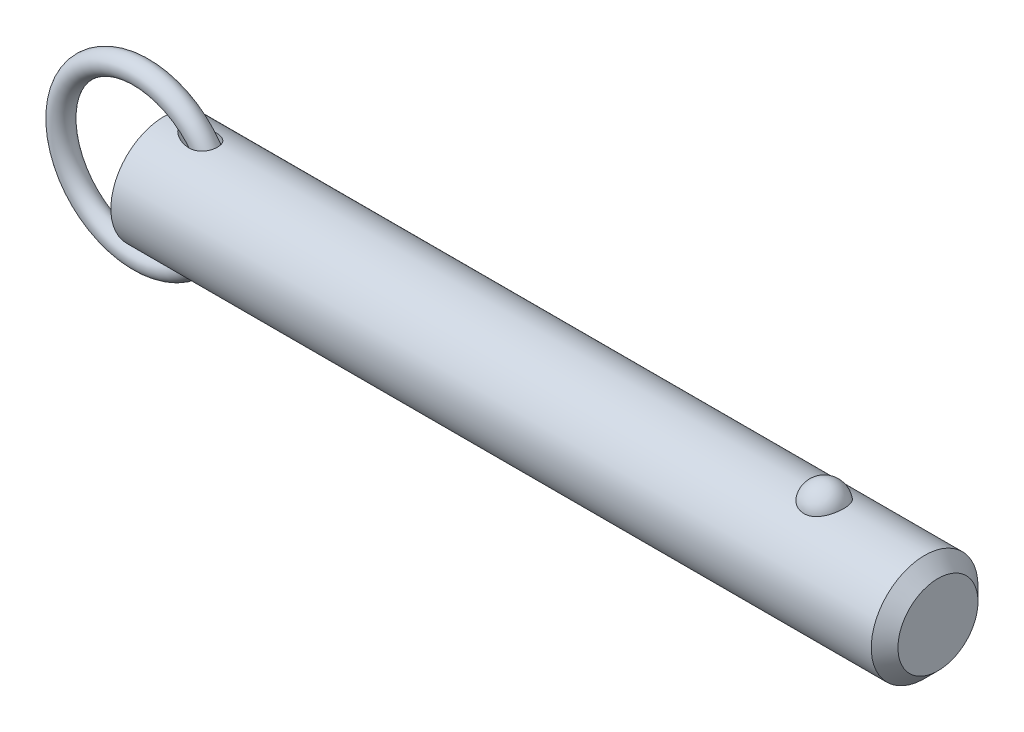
ISO-10303-21;
HEADER;
FILE_DESCRIPTION(('STEP AP214'),'2;1');
FILE_NAME('part.step','',(''),(''),'','','');
FILE_SCHEMA(('AUTOMOTIVE_DESIGN { 1 0 10303 214 1 1 1 1 }'));
ENDSEC;
DATA;
#1=APPLICATION_CONTEXT('core data for automotive mechanical design processes');
#2=APPLICATION_PROTOCOL_DEFINITION('international standard','automotive_design',2000,#1);
#3=PRODUCT_CONTEXT('',#1,'mechanical');
#4=PRODUCT('Part','Part','',(#3));
#5=PRODUCT_RELATED_PRODUCT_CATEGORY('part','',(#4));
#6=PRODUCT_DEFINITION_FORMATION('','',#4);
#7=PRODUCT_DEFINITION_CONTEXT('part definition',#1,'design');
#8=PRODUCT_DEFINITION('design','',#6,#7);
#9=PRODUCT_DEFINITION_SHAPE('','',#8);
#10=(LENGTH_UNIT() NAMED_UNIT(*) SI_UNIT(.MILLI.,.METRE.));
#11=(NAMED_UNIT(*) PLANE_ANGLE_UNIT() SI_UNIT($,.RADIAN.));
#12=(NAMED_UNIT(*) SI_UNIT($,.STERADIAN.) SOLID_ANGLE_UNIT());
#13=UNCERTAINTY_MEASURE_WITH_UNIT(LENGTH_MEASURE(1.E-05),#10,'distance_accuracy_value','');
#14=(GEOMETRIC_REPRESENTATION_CONTEXT(3) GLOBAL_UNCERTAINTY_ASSIGNED_CONTEXT((#13)) GLOBAL_UNIT_ASSIGNED_CONTEXT((#10,
#11,#12)) REPRESENTATION_CONTEXT('',''));
#15=CARTESIAN_POINT('',(0.,0.,0.));
#16=DIRECTION('',(0.,0.,1.));
#17=DIRECTION('',(1.,0.,0.));
#18=AXIS2_PLACEMENT_3D('',#15,#16,#17);
#19=CARTESIAN_POINT('',(-5.53898640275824,0.,0.));
#20=DIRECTION('',(0.,0.,1.));
#21=DIRECTION('',(1.,0.,0.));
#22=AXIS2_PLACEMENT_3D('',#19,#20,#21);
#23=TOROIDAL_SURFACE('',#22,19.05,2.54);
#24=CARTESIAN_POINT('',(16.0510135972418,0.,0.));
#25=VERTEX_POINT('',#24);
#26=VERTEX_LOOP('',#25);
#27=FACE_BOUND('',#26,.T.);
#28=ADVANCED_FACE('P0_F12',(#27),#23,.T.);
#29=CLOSED_SHELL('',(#28));
#30=MANIFOLD_SOLID_BREP('P0_B1',#29);
#31=CARTESIAN_POINT('',(0.,0.,0.));
#32=DIRECTION('',(1.,0.,0.));
#33=DIRECTION('',(0.,0.,-1.));
#34=AXIS2_PLACEMENT_3D('',#31,#32,#33);
#35=CYLINDRICAL_SURFACE('',#34,12.7);
#36=CARTESIAN_POINT('',(180.975,0.,0.));
#37=DIRECTION('',(1.,0.,0.));
#38=DIRECTION('',(0.,0.,-1.));
#39=AXIS2_PLACEMENT_3D('',#36,#37,#38);
#40=CIRCLE('',#39,12.7);
#41=CARTESIAN_POINT('',(180.975,0.,-12.7));
#42=VERTEX_POINT('',#41);
#43=EDGE_CURVE('P1_E89',#42,#42,#40,.T.);
#44=ORIENTED_EDGE('',*,*,#43,.F.);
#45=EDGE_LOOP('',(#44));
#46=FACE_BOUND('',#45,.T.);
#47=CARTESIAN_POINT('',(0.,0.,0.));
#48=DIRECTION('',(1.,0.,0.));
#49=DIRECTION('',(0.,0.,-1.));
#50=AXIS2_PLACEMENT_3D('',#47,#48,#49);
#51=CIRCLE('',#50,12.7);
#52=CARTESIAN_POINT('',(0.,0.,-12.7));
#53=VERTEX_POINT('',#52);
#54=EDGE_CURVE('P1_E52',#53,#53,#51,.T.);
#55=ORIENTED_EDGE('',*,*,#54,.T.);
#56=EDGE_LOOP('',(#55));
#57=FACE_BOUND('',#56,.T.);
#58=CARTESIAN_POINT('',(157.060042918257,11.7500437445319,4.81938502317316));
#59=CARTESIAN_POINT('',(156.935088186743,11.7500430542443,4.81938571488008));
#60=CARTESIAN_POINT('',(156.810144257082,11.7520975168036,4.81438658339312));
#61=CARTESIAN_POINT('',(156.561142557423,11.760253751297,4.79442904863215));
#62=CARTESIAN_POINT('',(156.437085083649,11.7663568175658,4.77946746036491));
#63=CARTESIAN_POINT('',(156.190901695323,11.7824262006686,4.73971414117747));
#64=CARTESIAN_POINT('',(156.068774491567,11.7923898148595,4.71492928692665));
#65=CARTESIAN_POINT('',(155.827187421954,11.8158938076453,4.65571340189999));
#66=CARTESIAN_POINT('',(155.70772859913,11.8294355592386,4.62127866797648));
#67=CARTESIAN_POINT('',(155.472557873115,11.8596812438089,4.54309502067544));
#68=CARTESIAN_POINT('',(155.356839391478,11.8763792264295,4.49936361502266));
#69=CARTESIAN_POINT('',(155.129653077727,11.9124878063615,4.40287235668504));
#70=CARTESIAN_POINT('',(155.018186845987,11.9318994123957,4.35010914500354));
#71=CARTESIAN_POINT('',(154.691278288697,11.9934256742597,4.17881316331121));
#72=CARTESIAN_POINT('',(154.483127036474,12.038858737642,4.04720756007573));
#73=CARTESIAN_POINT('',(154.085850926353,12.1352173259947,3.74856446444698));
#74=CARTESIAN_POINT('',(153.897443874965,12.1862630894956,3.58061821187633));
#75=CARTESIAN_POINT('',(153.550521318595,12.2875163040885,3.21600758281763));
#76=CARTESIAN_POINT('',(153.392011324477,12.3377235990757,3.01933792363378));
#77=CARTESIAN_POINT('',(153.10168878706,12.4344923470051,2.59291655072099));
#78=CARTESIAN_POINT('',(152.971376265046,12.4807925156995,2.36208286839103));
#79=CARTESIAN_POINT('',(152.749407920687,12.5623454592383,1.88070399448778));
#80=CARTESIAN_POINT('',(152.657755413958,12.5975972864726,1.63015711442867));
#81=CARTESIAN_POINT('',(152.514046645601,12.6538414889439,1.1129886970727));
#82=CARTESIAN_POINT('',(152.462499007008,12.6746503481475,0.846205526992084));
#83=CARTESIAN_POINT('',(152.401977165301,12.699153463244,0.307085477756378));
#84=CARTESIAN_POINT('',(152.393001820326,12.7028481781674,0.0347487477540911));
#85=CARTESIAN_POINT('',(152.417731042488,12.6927785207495,-0.506073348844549));
#86=CARTESIAN_POINT('',(152.451189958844,12.6791146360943,-0.774571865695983));
#87=CARTESIAN_POINT('',(152.559687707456,12.635882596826,-1.3017024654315));
#88=CARTESIAN_POINT('',(152.63472729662,12.6063141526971,-1.56033436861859));
#89=CARTESIAN_POINT('',(152.825000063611,12.5342328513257,-2.06083899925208));
#90=CARTESIAN_POINT('',(152.940287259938,12.4917026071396,-2.30268867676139));
#91=CARTESIAN_POINT('',(153.208704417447,12.3981123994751,-2.76259600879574));
#92=CARTESIAN_POINT('',(153.361837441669,12.3470517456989,-2.98065173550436));
#93=CARTESIAN_POINT('',(153.703507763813,12.2416045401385,-3.387863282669));
#94=CARTESIAN_POINT('',(153.892201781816,12.1872040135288,-3.57688418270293));
#95=CARTESIAN_POINT('',(154.300239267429,12.0814086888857,-3.91941073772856));
#96=CARTESIAN_POINT('',(154.519580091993,12.0300136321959,-4.07291945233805));
#97=CARTESIAN_POINT('',(154.978375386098,11.9373542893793,-4.33691289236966));
#98=CARTESIAN_POINT('',(155.217304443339,11.8958982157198,-4.44824125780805));
#99=CARTESIAN_POINT('',(155.71243761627,11.8268116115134,-4.62881985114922));
#100=CARTESIAN_POINT('',(155.968635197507,11.7991758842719,-4.69808589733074));
#101=CARTESIAN_POINT('',(156.477164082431,11.7622209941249,-4.78983181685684));
#102=CARTESIAN_POINT('',(156.729041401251,11.7520502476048,-4.8144902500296));
#103=CARTESIAN_POINT('',(157.233573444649,11.7485796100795,-4.82295735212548));
#104=CARTESIAN_POINT('',(157.486228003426,11.7552763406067,-4.80677420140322));
#105=CARTESIAN_POINT('',(157.976834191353,11.7842584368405,-4.73525430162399));
#106=CARTESIAN_POINT('',(158.214998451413,11.8060486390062,-4.68116061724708));
#107=CARTESIAN_POINT('',(158.678489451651,11.8622750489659,-4.53678133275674));
#108=CARTESIAN_POINT('',(158.903815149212,11.8967122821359,-4.44649279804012));
#109=CARTESIAN_POINT('',(159.340801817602,11.9754603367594,-4.22987613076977));
#110=CARTESIAN_POINT('',(159.552057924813,12.0199699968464,-4.10280539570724));
#111=CARTESIAN_POINT('',(159.950601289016,12.1138028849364,-3.81685409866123));
#112=CARTESIAN_POINT('',(160.137883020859,12.163127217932,-3.65796622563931));
#113=CARTESIAN_POINT('',(160.493350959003,12.2642343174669,-3.30364864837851));
#114=CARTESIAN_POINT('',(160.660111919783,12.3160165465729,-3.10678783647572));
#115=CARTESIAN_POINT('',(160.959579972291,12.4142566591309,-2.68748409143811));
#116=CARTESIAN_POINT('',(161.092280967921,12.4607135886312,-2.46503658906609));
#117=CARTESIAN_POINT('',(161.324691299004,12.5450236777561,-1.99289519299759));
#118=CARTESIAN_POINT('',(161.423215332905,12.5825557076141,-1.74255918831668));
#119=CARTESIAN_POINT('',(161.579227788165,12.6431720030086,-1.2277373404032));
#120=CARTESIAN_POINT('',(161.636715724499,12.6662560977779,-0.963251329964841));
#121=CARTESIAN_POINT('',(161.709544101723,12.6956486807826,-0.427355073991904));
#122=CARTESIAN_POINT('',(161.724837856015,12.7019385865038,-0.155937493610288));
#123=CARTESIAN_POINT('',(161.712779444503,12.6970201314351,0.385928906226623));
#124=CARTESIAN_POINT('',(161.68542805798,12.6858120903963,0.656377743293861));
#125=CARTESIAN_POINT('',(161.613060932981,12.6568455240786,1.05454017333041));
#126=CARTESIAN_POINT('',(161.583796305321,12.6451962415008,1.18577850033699));
#127=CARTESIAN_POINT('',(161.515022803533,12.6181819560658,1.44513808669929));
#128=CARTESIAN_POINT('',(161.475517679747,12.6028183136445,1.57326046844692));
#129=CARTESIAN_POINT('',(161.386439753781,12.5687547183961,1.82554978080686));
#130=CARTESIAN_POINT('',(161.336862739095,12.5500533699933,1.94971503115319));
#131=CARTESIAN_POINT('',(161.22792115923,12.5098093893,2.1931437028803));
#132=CARTESIAN_POINT('',(161.168560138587,12.4882677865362,2.31240887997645));
#133=CARTESIAN_POINT('',(161.03997128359,12.4427679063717,2.54593031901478));
#134=CARTESIAN_POINT('',(160.970688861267,12.4187964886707,2.6601539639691));
#135=CARTESIAN_POINT('',(160.822903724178,12.3691892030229,2.88202659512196));
#136=CARTESIAN_POINT('',(160.744404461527,12.3435539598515,2.98967802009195));
#137=CARTESIAN_POINT('',(160.578550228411,12.2912955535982,3.19774385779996));
#138=CARTESIAN_POINT('',(160.491191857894,12.2646720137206,3.29815546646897));
#139=CARTESIAN_POINT('',(160.308161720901,12.2111945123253,3.49095035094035));
#140=CARTESIAN_POINT('',(160.212493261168,12.1843406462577,3.58333679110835));
#141=CARTESIAN_POINT('',(160.013627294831,12.1312249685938,3.75922876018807));
#142=CARTESIAN_POINT('',(159.910450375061,12.104961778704,3.84275713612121));
#143=CARTESIAN_POINT('',(159.69701336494,12.0537284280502,4.00056406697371));
#144=CARTESIAN_POINT('',(159.586756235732,12.028757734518,4.07484645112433));
#145=CARTESIAN_POINT('',(159.359755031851,11.9808306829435,4.21367959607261));
#146=CARTESIAN_POINT('',(159.243006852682,11.9578756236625,4.27822410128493));
#147=CARTESIAN_POINT('',(159.00394258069,11.9147184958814,4.3969848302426));
#148=CARTESIAN_POINT('',(158.881628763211,11.894515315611,4.45120522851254));
#149=CARTESIAN_POINT('',(158.622952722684,11.8561129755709,4.55255353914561));
#150=CARTESIAN_POINT('',(158.486223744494,11.8381764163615,4.59884858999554));
#151=CARTESIAN_POINT('',(158.208608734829,11.8069093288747,4.67853897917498));
#152=CARTESIAN_POINT('',(158.067724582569,11.7935767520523,4.71194005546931));
#153=CARTESIAN_POINT('',(157.78309446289,11.7720277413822,4.7655218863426));
#154=CARTESIAN_POINT('',(157.639348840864,11.7638106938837,4.7857042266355));
#155=CARTESIAN_POINT('',(157.350411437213,11.7528195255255,4.81263433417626));
#156=CARTESIAN_POINT('',(157.205219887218,11.7500445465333,4.81938421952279));
#157=CARTESIAN_POINT('',(157.060042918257,11.7500437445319,4.81938502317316));
#158=B_SPLINE_CURVE_WITH_KNOTS('',3,(#58,#59,#60,#61,#62,#63,#64,#65,#66,#67,#68,#69,#70,#71,
#72,#73,#74,#75,#76,#77,#78,#79,#80,#81,#82,#83,#84,#85,#86,#87,#88,#89,#90,#91,#92,#93,#94,#95,
#96,#97,#98,#99,#100,#101,#102,#103,#104,#105,#106,#107,#108,#109,#110,#111,#112,#113,#114,#115,
#116,#117,#118,#119,#120,#121,#122,#123,#124,#125,#126,#127,#128,#129,#130,#131,#132,#133,#134,
#135,#136,#137,#138,#139,#140,#141,#142,#143,#144,#145,#146,#147,#148,#149,#150,#151,#152,#153,
#154,#155,#156,#157),.UNSPECIFIED.,.T.,.F.,(4,2,2,2,2,2,2,2,2,2,2,2,2,2,2,2,2,2,2,2,2,2,2,2,2,2,
2,2,2,2,2,2,2,2,2,2,2,2,2,2,2,2,2,2,2,2,2,2,2,4),(0.,0.374729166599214,0.749578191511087,
1.12416526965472,1.49889629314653,1.87292776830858,2.24709865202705,2.99481328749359,
3.76399449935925,4.53331735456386,5.33683915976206,6.14042986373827,6.95405296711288,
7.76765424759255,8.57656703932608,9.38549455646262,10.1955119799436,11.0055949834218,
11.8193353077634,12.6330054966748,13.4294141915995,14.2255231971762,14.9815786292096,
15.7374826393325,16.4696948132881,17.2019663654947,17.950197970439,18.6986017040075,
19.4844704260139,20.2704797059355,21.0815215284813,21.8925729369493,22.7045213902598,
23.5164550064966,23.9209608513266,24.3253187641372,24.7298461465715,25.1342272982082,
25.5409255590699,25.9474719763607,26.3541750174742,26.760716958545,27.1661834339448,
27.5714814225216,27.9770386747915,28.3824315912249,28.8181206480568,29.253615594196,
29.6890582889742,30.1244323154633),.UNSPECIFIED.);
#159=CARTESIAN_POINT('',(157.060042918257,11.7500437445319,4.81938502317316));
#160=VERTEX_POINT('',#159);
#161=EDGE_CURVE('P1_E80',#160,#160,#158,.T.);
#162=ORIENTED_EDGE('',*,*,#161,.T.);
#163=EDGE_LOOP('',(#162));
#164=FACE_BOUND('',#163,.T.);
#165=CARTESIAN_POINT('',(-5.53898640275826,0.,0.));
#166=DIRECTION('',(0.796400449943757,-0.604769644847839,0.));
#167=DIRECTION('',(0.604769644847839,0.796400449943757,0.));
#168=AXIS2_PLACEMENT_3D('',#165,#166,#167);
#169=ELLIPSE('',#168,15.9467514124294,12.7);
#170=CARTESIAN_POINT('',(4.09482149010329,12.6864319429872,0.586893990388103));
#171=VERTEX_POINT('',#170);
#172=CARTESIAN_POINT('',(4.09482149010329,12.6864319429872,-0.586893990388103));
#173=VERTEX_POINT('',#172);
#174=EDGE_CURVE('P1_E47',#171,#173,#169,.F.);
#175=ORIENTED_EDGE('',*,*,#174,.T.);
#176=CARTESIAN_POINT('',(4.06153170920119,12.6905758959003,-0.48916605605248));
#177=CARTESIAN_POINT('',(4.08111374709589,12.6881366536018,-0.552489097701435));
#178=CARTESIAN_POINT('',(4.1041785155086,12.6852663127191,-0.614604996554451));
#179=CARTESIAN_POINT('',(4.15628434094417,12.6787965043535,-0.736067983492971));
#180=CARTESIAN_POINT('',(4.18531032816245,12.6751988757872,-0.795421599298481));
#181=CARTESIAN_POINT('',(4.27911159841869,12.6636052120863,-0.967590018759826));
#182=CARTESIAN_POINT('',(4.35123408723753,12.654730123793,-1.07635920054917));
#183=CARTESIAN_POINT('',(4.49106800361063,12.6376715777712,-1.25922957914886));
#184=CARTESIAN_POINT('',(4.55601066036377,12.6297947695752,-1.33556751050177));
#185=CARTESIAN_POINT('',(4.69223626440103,12.6134116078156,-1.48232741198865));
#186=CARTESIAN_POINT('',(4.76352147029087,12.6049050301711,-1.55274725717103));
#187=CARTESIAN_POINT('',(4.911639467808,12.587417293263,-1.68868704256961));
#188=CARTESIAN_POINT('',(4.98851399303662,12.5784327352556,-1.75416062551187));
#189=CARTESIAN_POINT('',(5.14630057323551,12.560235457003,-1.88003275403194));
#190=CARTESIAN_POINT('',(5.22721398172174,12.5510226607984,-1.94042957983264));
#191=CARTESIAN_POINT('',(5.45368877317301,12.5256514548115,-2.09966332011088));
#192=CARTESIAN_POINT('',(5.60261616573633,12.5094182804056,-2.19371988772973));
#193=CARTESIAN_POINT('',(5.90795545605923,12.4774211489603,-2.36893890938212));
#194=CARTESIAN_POINT('',(6.06437232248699,12.4616575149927,-2.45009264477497));
#195=CARTESIAN_POINT('',(6.38306132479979,12.431227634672,-2.60008249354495));
#196=CARTESIAN_POINT('',(6.54533237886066,12.4165611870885,-2.66892086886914));
#197=CARTESIAN_POINT('',(6.87462618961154,12.3889351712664,-2.79435199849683));
#198=CARTESIAN_POINT('',(7.04164773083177,12.3759751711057,-2.85094785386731));
#199=CARTESIAN_POINT('',(7.38726647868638,12.3518460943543,-2.95377962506));
#200=CARTESIAN_POINT('',(7.56604577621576,12.3407843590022,-2.9994320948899));
#201=CARTESIAN_POINT('',(7.92698692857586,12.3219309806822,-3.07596683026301));
#202=CARTESIAN_POINT('',(8.10914972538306,12.314140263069,-3.1068449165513));
#203=CARTESIAN_POINT('',(8.475114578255,12.3025918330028,-3.15226850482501));
#204=CARTESIAN_POINT('',(8.65890979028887,12.2988216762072,-3.16686440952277));
#205=CARTESIAN_POINT('',(9.02696087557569,12.2959421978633,-3.17802250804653));
#206=CARTESIAN_POINT('',(9.21121628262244,12.2968292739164,-3.17459864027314));
#207=CARTESIAN_POINT('',(9.61636263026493,12.3045198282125,-3.14471110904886));
#208=CARTESIAN_POINT('',(9.83695552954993,12.3125080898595,-3.1136323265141));
#209=CARTESIAN_POINT('',(10.1619126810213,12.3303028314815,-3.04206574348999));
#210=CARTESIAN_POINT('',(10.2692747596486,12.3372061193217,-3.01403983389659));
#211=CARTESIAN_POINT('',(10.4811758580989,12.3528538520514,-2.94925947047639));
#212=CARTESIAN_POINT('',(10.5857162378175,12.361597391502,-2.91250930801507));
#213=CARTESIAN_POINT('',(10.7921321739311,12.3808585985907,-2.82951748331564));
#214=CARTESIAN_POINT('',(10.8939665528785,12.3913944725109,-2.78317723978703));
#215=CARTESIAN_POINT('',(11.0926118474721,12.4138762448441,-2.68112002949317));
#216=CARTESIAN_POINT('',(11.1894254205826,12.4258213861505,-2.62540809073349));
#217=CARTESIAN_POINT('',(11.3768740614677,12.4507225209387,-2.5046565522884));
#218=CARTESIAN_POINT('',(11.46751150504,12.4636781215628,-2.43962056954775));
#219=CARTESIAN_POINT('',(11.6414572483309,12.4901070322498,-2.30048560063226));
#220=CARTESIAN_POINT('',(11.7247669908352,12.5035802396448,-2.22638840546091));
#221=CARTESIAN_POINT('',(11.8713131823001,12.5285000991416,-2.08117367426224));
#222=CARTESIAN_POINT('',(11.9357009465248,12.5399538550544,-2.01121596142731));
#223=CARTESIAN_POINT('',(12.0576805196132,12.5624496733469,-1.86555293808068));
#224=CARTESIAN_POINT('',(12.1152732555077,12.5734917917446,-1.78984841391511));
#225=CARTESIAN_POINT('',(12.223073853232,12.5947858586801,-1.63327883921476));
#226=CARTESIAN_POINT('',(12.2732844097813,12.6050380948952,-1.55241568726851));
#227=CARTESIAN_POINT('',(12.3658430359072,12.6243983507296,-1.3862126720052));
#228=CARTESIAN_POINT('',(12.4081916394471,12.6335064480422,-1.30087311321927));
#229=CARTESIAN_POINT('',(12.5150098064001,12.6569076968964,-1.05702619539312));
#230=CARTESIAN_POINT('',(12.5703399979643,12.6695746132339,-0.894232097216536));
#231=CARTESIAN_POINT('',(12.6526225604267,12.6886816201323,-0.561391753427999));
#232=CARTESIAN_POINT('',(12.6795825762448,12.6951233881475,-0.391347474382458));
#233=CARTESIAN_POINT('',(12.7041016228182,12.7009766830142,-0.0537636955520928));
#234=CARTESIAN_POINT('',(12.7024538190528,12.7005778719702,0.113714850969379));
#235=CARTESIAN_POINT('',(12.6717240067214,12.6932548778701,0.445979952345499));
#236=CARTESIAN_POINT('',(12.6426435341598,12.6863310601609,0.610766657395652));
#237=CARTESIAN_POINT('',(12.5579769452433,12.6667465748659,0.932429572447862));
#238=CARTESIAN_POINT('',(12.5024793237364,12.6541050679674,1.08933027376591));
#239=CARTESIAN_POINT('',(12.3665691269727,12.6244558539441,1.39146752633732));
#240=CARTESIAN_POINT('',(12.2861577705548,12.6074483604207,1.53670464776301));
#241=CARTESIAN_POINT('',(12.1018203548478,12.5706804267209,1.81319588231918));
#242=CARTESIAN_POINT('',(11.99765881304,12.5508932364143,1.94428915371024));
#243=CARTESIAN_POINT('',(11.7695265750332,12.5107540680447,2.18776051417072));
#244=CARTESIAN_POINT('',(11.6455540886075,12.4904020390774,2.30013691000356));
#245=CARTESIAN_POINT('',(11.3759347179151,12.4502278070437,2.50870972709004));
#246=CARTESIAN_POINT('',(11.2295880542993,12.4304654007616,2.60400962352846));
#247=CARTESIAN_POINT('',(10.9239803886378,12.3941696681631,2.7716292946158));
#248=CARTESIAN_POINT('',(10.7647152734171,12.3776373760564,2.84394171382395));
#249=CARTESIAN_POINT('',(10.4192039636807,12.3473062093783,2.9730352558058));
#250=CARTESIAN_POINT('',(10.231933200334,12.3340204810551,3.02717164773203));
#251=CARTESIAN_POINT('',(9.85152982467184,12.3134301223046,3.10986173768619));
#252=CARTESIAN_POINT('',(9.65839336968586,12.3061295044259,3.13839827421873));
#253=CARTESIAN_POINT('',(9.3102251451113,12.2982822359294,3.16897517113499));
#254=CARTESIAN_POINT('',(9.15555718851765,12.2966525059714,3.1752689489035));
#255=CARTESIAN_POINT('',(8.84618945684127,12.2967963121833,3.17471335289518));
#256=CARTESIAN_POINT('',(8.69148970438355,12.2985715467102,3.16785742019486));
#257=CARTESIAN_POINT('',(8.38280471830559,12.3051648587,3.14214692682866));
#258=CARTESIAN_POINT('',(8.22882218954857,12.3099904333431,3.12326280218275));
#259=CARTESIAN_POINT('',(7.92276070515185,12.3222644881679,3.07448013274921));
#260=CARTESIAN_POINT('',(7.77068148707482,12.3297126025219,3.04458312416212));
#261=CARTESIAN_POINT('',(7.46452663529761,12.3470493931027,2.97350781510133));
#262=CARTESIAN_POINT('',(7.31052714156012,12.3570043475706,2.93201910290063));
#263=CARTESIAN_POINT('',(7.00579083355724,12.3787609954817,2.83876185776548));
#264=CARTESIAN_POINT('',(6.85505451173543,12.3905629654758,2.78699178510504));
#265=CARTESIAN_POINT('',(6.5578120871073,12.415528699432,2.6735774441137));
#266=CARTESIAN_POINT('',(6.41129783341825,12.4286895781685,2.61195394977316));
#267=CARTESIAN_POINT('',(6.1230295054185,12.4559398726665,2.47874512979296));
#268=CARTESIAN_POINT('',(5.98127390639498,12.4700289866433,2.40716303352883));
#269=CARTESIAN_POINT('',(5.67073126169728,12.5020754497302,2.2355042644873));
#270=CARTESIAN_POINT('',(5.50343839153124,12.5201625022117,2.13268685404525));
#271=CARTESIAN_POINT('',(5.26147616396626,12.5471537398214,1.96522579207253));
#272=CARTESIAN_POINT('',(5.18224299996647,12.5561365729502,1.90713440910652));
#273=CARTESIAN_POINT('',(5.02746475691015,12.573912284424,1.78618989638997));
#274=CARTESIAN_POINT('',(4.95191912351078,12.5827051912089,1.72333748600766));
#275=CARTESIAN_POINT('',(4.81787163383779,12.598469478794,1.60360864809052));
#276=CARTESIAN_POINT('',(4.75865966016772,12.6054958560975,1.54753994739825));
#277=CARTESIAN_POINT('',(4.64406285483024,12.6191906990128,1.43158546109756));
#278=CARTESIAN_POINT('',(4.58867926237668,12.6258590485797,1.37169845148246));
#279=CARTESIAN_POINT('',(4.43014912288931,12.6450546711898,1.18656670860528));
#280=CARTESIAN_POINT('',(4.33372726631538,12.6568788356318,1.05507993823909));
#281=CARTESIAN_POINT('',(4.2125205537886,12.6718304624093,0.848052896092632));
#282=CARTESIAN_POINT('',(4.17660155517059,12.6762773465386,0.779100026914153));
#283=CARTESIAN_POINT('',(4.11264979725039,12.6842122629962,0.637080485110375));
#284=CARTESIAN_POINT('',(4.08466792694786,12.6876941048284,0.563990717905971));
#285=CARTESIAN_POINT('',(4.06153170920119,12.6905758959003,0.48916605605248));
#286=B_SPLINE_CURVE_WITH_KNOTS('',3,(#176,#177,#178,#179,#180,#181,#182,#183,#184,#185,#186,
#187,#188,#189,#190,#191,#192,#193,#194,#195,#196,#197,#198,#199,#200,#201,#202,#203,#204,#205,
#206,#207,#208,#209,#210,#211,#212,#213,#214,#215,#216,#217,#218,#219,#220,#221,#222,#223,#224,
#225,#226,#227,#228,#229,#230,#231,#232,#233,#234,#235,#236,#237,#238,#239,#240,#241,#242,#243,
#244,#245,#246,#247,#248,#249,#250,#251,#252,#253,#254,#255,#256,#257,#258,#259,#260,#261,#262,
#263,#264,#265,#266,#267,#268,#269,#270,#271,#272,#273,#274,#275,#276,#277,#278,#279,#280,#281,
#282,#283,#284,#285),.UNSPECIFIED.,.F.,.F.,(4,2,2,2,2,2,2,2,2,2,2,2,2,2,2,2,2,2,2,2,2,2,2,2,2,2,
2,2,2,2,2,2,2,2,2,2,2,2,2,2,2,2,2,2,2,2,2,2,2,2,2,2,2,2,4),(0.,0.198708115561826,
0.396919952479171,0.787580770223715,1.08882492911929,1.39017679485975,1.69407136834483,
1.99806847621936,2.52793143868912,3.05815092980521,3.58827293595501,4.11826050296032,
4.67218806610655,5.22627222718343,5.77863637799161,6.3305733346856,6.99657211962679,
7.32977411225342,7.66281254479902,7.99946156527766,8.33593054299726,8.672269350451,
9.00854178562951,9.29544181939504,9.58230266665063,9.86905853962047,10.1557949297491,
10.6702338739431,11.1845341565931,11.6845985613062,12.1846349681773,12.6830079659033,
13.1813565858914,13.68487951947,14.1884479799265,14.713533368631,15.2387866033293,
15.8228373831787,16.407279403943,16.8710810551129,17.3351141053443,17.8002921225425,
18.2654052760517,18.7444169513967,19.2235004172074,19.7015868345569,20.1795185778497,
20.7699825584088,21.0658110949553,21.3615950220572,21.606957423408,21.8523988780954,
22.3397467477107,22.5729183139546,22.8075527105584),.UNSPECIFIED.);
#287=EDGE_CURVE('P1_E51',#173,#171,#286,.T.);
#288=ORIENTED_EDGE('',*,*,#287,.T.);
#289=EDGE_LOOP('',(#175,#288));
#290=FACE_BOUND('',#289,.T.);
#291=CARTESIAN_POINT('',(-5.53898640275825,0.,0.));
#292=DIRECTION('',(-0.796400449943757,-0.604769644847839,0.));
#293=DIRECTION('',(0.604769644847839,-0.796400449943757,0.));
#294=AXIS2_PLACEMENT_3D('',#291,#292,#293);
#295=ELLIPSE('',#294,15.9467514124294,12.7);
#296=CARTESIAN_POINT('',(4.0948214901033,-12.6864319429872,0.586893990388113));
#297=VERTEX_POINT('',#296);
#298=CARTESIAN_POINT('',(4.0948214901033,-12.6864319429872,-0.586893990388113));
#299=VERTEX_POINT('',#298);
#300=EDGE_CURVE('P1_E28',#297,#299,#295,.F.);
#301=ORIENTED_EDGE('',*,*,#300,.F.);
#302=CARTESIAN_POINT('',(4.06153170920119,-12.6905758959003,0.48916605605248));
#303=CARTESIAN_POINT('',(4.08111374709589,-12.6881366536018,0.552489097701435));
#304=CARTESIAN_POINT('',(4.1041785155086,-12.6852663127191,0.614604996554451));
#305=CARTESIAN_POINT('',(4.15628434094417,-12.6787965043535,0.736067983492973));
#306=CARTESIAN_POINT('',(4.18531032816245,-12.6751988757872,0.795421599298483));
#307=CARTESIAN_POINT('',(4.27911159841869,-12.6636052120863,0.967590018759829));
#308=CARTESIAN_POINT('',(4.35123408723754,-12.654730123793,1.07635920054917));
#309=CARTESIAN_POINT('',(4.49106800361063,-12.6376715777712,1.25922957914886));
#310=CARTESIAN_POINT('',(4.55601066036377,-12.6297947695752,1.33556751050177));
#311=CARTESIAN_POINT('',(4.69223626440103,-12.6134116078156,1.48232741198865));
#312=CARTESIAN_POINT('',(4.76352147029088,-12.6049050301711,1.55274725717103));
#313=CARTESIAN_POINT('',(4.91163946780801,-12.587417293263,1.68868704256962));
#314=CARTESIAN_POINT('',(4.98851399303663,-12.5784327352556,1.75416062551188));
#315=CARTESIAN_POINT('',(5.14630057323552,-12.560235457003,1.88003275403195));
#316=CARTESIAN_POINT('',(5.22721398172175,-12.5510226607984,1.94042957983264));
#317=CARTESIAN_POINT('',(5.45368877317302,-12.5256514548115,2.09966332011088));
#318=CARTESIAN_POINT('',(5.60261616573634,-12.5094182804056,2.19371988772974));
#319=CARTESIAN_POINT('',(5.90795545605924,-12.4774211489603,2.36893890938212));
#320=CARTESIAN_POINT('',(6.06437232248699,-12.4616575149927,2.45009264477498));
#321=CARTESIAN_POINT('',(6.3830613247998,-12.431227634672,2.60008249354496));
#322=CARTESIAN_POINT('',(6.54533237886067,-12.4165611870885,2.66892086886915));
#323=CARTESIAN_POINT('',(6.87462618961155,-12.3889351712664,2.79435199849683));
#324=CARTESIAN_POINT('',(7.04164773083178,-12.3759751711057,2.85094785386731));
#325=CARTESIAN_POINT('',(7.38726647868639,-12.3518460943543,2.95377962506));
#326=CARTESIAN_POINT('',(7.56604577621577,-12.3407843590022,2.9994320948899));
#327=CARTESIAN_POINT('',(7.92698692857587,-12.3219309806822,3.07596683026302));
#328=CARTESIAN_POINT('',(8.10914972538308,-12.314140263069,3.1068449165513));
#329=CARTESIAN_POINT('',(8.47511457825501,-12.3025918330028,3.15226850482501));
#330=CARTESIAN_POINT('',(8.65890979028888,-12.2988216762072,3.16686440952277));
#331=CARTESIAN_POINT('',(9.02696087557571,-12.2959421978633,3.17802250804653));
#332=CARTESIAN_POINT('',(9.21121628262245,-12.2968292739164,3.17459864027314));
#333=CARTESIAN_POINT('',(9.61636263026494,-12.3045198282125,3.14471110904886));
#334=CARTESIAN_POINT('',(9.83695552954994,-12.3125080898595,3.1136323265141));
#335=CARTESIAN_POINT('',(10.1619126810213,-12.3303028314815,3.04206574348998));
#336=CARTESIAN_POINT('',(10.2692747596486,-12.3372061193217,3.01403983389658));
#337=CARTESIAN_POINT('',(10.4811758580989,-12.3528538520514,2.94925947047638));
#338=CARTESIAN_POINT('',(10.5857162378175,-12.361597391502,2.91250930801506));
#339=CARTESIAN_POINT('',(10.7921321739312,-12.3808585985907,2.82951748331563));
#340=CARTESIAN_POINT('',(10.8939665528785,-12.3913944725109,2.78317723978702));
#341=CARTESIAN_POINT('',(11.0926118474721,-12.4138762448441,2.68112002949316));
#342=CARTESIAN_POINT('',(11.1894254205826,-12.4258213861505,2.62540809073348));
#343=CARTESIAN_POINT('',(11.3768740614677,-12.4507225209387,2.50465655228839));
#344=CARTESIAN_POINT('',(11.46751150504,-12.4636781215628,2.43962056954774));
#345=CARTESIAN_POINT('',(11.6414572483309,-12.4901070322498,2.30048560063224));
#346=CARTESIAN_POINT('',(11.7247669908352,-12.5035802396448,2.22638840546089));
#347=CARTESIAN_POINT('',(11.8713131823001,-12.5285000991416,2.08117367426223));
#348=CARTESIAN_POINT('',(11.9357009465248,-12.5399538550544,2.01121596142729));
#349=CARTESIAN_POINT('',(12.0576805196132,-12.5624496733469,1.86555293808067));
#350=CARTESIAN_POINT('',(12.1152732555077,-12.5734917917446,1.7898484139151));
#351=CARTESIAN_POINT('',(12.223073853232,-12.5947858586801,1.63327883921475));
#352=CARTESIAN_POINT('',(12.2732844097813,-12.6050380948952,1.5524156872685));
#353=CARTESIAN_POINT('',(12.3658430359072,-12.6243983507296,1.38621267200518));
#354=CARTESIAN_POINT('',(12.4081916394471,-12.6335064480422,1.30087311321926));
#355=CARTESIAN_POINT('',(12.5150098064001,-12.6569076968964,1.0570261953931));
#356=CARTESIAN_POINT('',(12.5703399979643,-12.6695746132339,0.894232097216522));
#357=CARTESIAN_POINT('',(12.6526225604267,-12.6886816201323,0.561391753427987));
#358=CARTESIAN_POINT('',(12.6795825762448,-12.6951233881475,0.391347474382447));
#359=CARTESIAN_POINT('',(12.7041016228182,-12.7009766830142,0.0537636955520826));
#360=CARTESIAN_POINT('',(12.7024538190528,-12.7005778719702,-0.113714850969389));
#361=CARTESIAN_POINT('',(12.6717240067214,-12.6932548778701,-0.445979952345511));
#362=CARTESIAN_POINT('',(12.6426435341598,-12.6863310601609,-0.610766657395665));
#363=CARTESIAN_POINT('',(12.5579769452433,-12.6667465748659,-0.932429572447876));
#364=CARTESIAN_POINT('',(12.5024793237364,-12.6541050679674,-1.08933027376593));
#365=CARTESIAN_POINT('',(12.3665691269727,-12.6244558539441,-1.39146752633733));
#366=CARTESIAN_POINT('',(12.2861577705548,-12.6074483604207,-1.53670464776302));
#367=CARTESIAN_POINT('',(12.1018203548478,-12.5706804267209,-1.81319588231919));
#368=CARTESIAN_POINT('',(11.99765881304,-12.5508932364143,-1.94428915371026));
#369=CARTESIAN_POINT('',(11.7695265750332,-12.5107540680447,-2.18776051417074));
#370=CARTESIAN_POINT('',(11.6455540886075,-12.4904020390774,-2.30013691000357));
#371=CARTESIAN_POINT('',(11.375934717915,-12.4502278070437,-2.50870972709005));
#372=CARTESIAN_POINT('',(11.2295880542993,-12.4304654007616,-2.60400962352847));
#373=CARTESIAN_POINT('',(10.9239803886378,-12.3941696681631,-2.77162929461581));
#374=CARTESIAN_POINT('',(10.7647152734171,-12.3776373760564,-2.84394171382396));
#375=CARTESIAN_POINT('',(10.4192039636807,-12.3473062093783,-2.9730352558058));
#376=CARTESIAN_POINT('',(10.2319332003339,-12.3340204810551,-3.02717164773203));
#377=CARTESIAN_POINT('',(9.85152982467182,-12.3134301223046,-3.10986173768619));
#378=CARTESIAN_POINT('',(9.65839336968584,-12.3061295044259,-3.13839827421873));
#379=CARTESIAN_POINT('',(9.31022514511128,-12.2982822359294,-3.16897517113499));
#380=CARTESIAN_POINT('',(9.15555718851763,-12.2966525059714,-3.1752689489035));
#381=CARTESIAN_POINT('',(8.84618945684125,-12.2967963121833,-3.17471335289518));
#382=CARTESIAN_POINT('',(8.69148970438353,-12.2985715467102,-3.16785742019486));
#383=CARTESIAN_POINT('',(8.38280471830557,-12.3051648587,-3.14214692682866));
#384=CARTESIAN_POINT('',(8.22882218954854,-12.3099904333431,-3.12326280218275));
#385=CARTESIAN_POINT('',(7.92276070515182,-12.3222644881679,-3.07448013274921));
#386=CARTESIAN_POINT('',(7.77068148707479,-12.3297126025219,-3.04458312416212));
#387=CARTESIAN_POINT('',(7.46452663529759,-12.3470493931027,-2.97350781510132));
#388=CARTESIAN_POINT('',(7.31052714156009,-12.3570043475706,-2.93201910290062));
#389=CARTESIAN_POINT('',(7.00579083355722,-12.3787609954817,-2.83876185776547));
#390=CARTESIAN_POINT('',(6.8550545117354,-12.3905629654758,-2.78699178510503));
#391=CARTESIAN_POINT('',(6.55781208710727,-12.415528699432,-2.67357744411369));
#392=CARTESIAN_POINT('',(6.41129783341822,-12.4286895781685,-2.61195394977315));
#393=CARTESIAN_POINT('',(6.12302950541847,-12.4559398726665,-2.47874512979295));
#394=CARTESIAN_POINT('',(5.98127390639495,-12.4700289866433,-2.40716303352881));
#395=CARTESIAN_POINT('',(5.67073126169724,-12.5020754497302,-2.23550426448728));
#396=CARTESIAN_POINT('',(5.50343839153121,-12.5201625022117,-2.13268685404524));
#397=CARTESIAN_POINT('',(5.26147616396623,-12.5471537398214,-1.96522579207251));
#398=CARTESIAN_POINT('',(5.18224299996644,-12.5561365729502,-1.9071344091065));
#399=CARTESIAN_POINT('',(5.02746475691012,-12.573912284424,-1.78618989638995));
#400=CARTESIAN_POINT('',(4.95191912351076,-12.5827051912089,-1.72333748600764));
#401=CARTESIAN_POINT('',(4.81787163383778,-12.598469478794,-1.6036086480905));
#402=CARTESIAN_POINT('',(4.7586596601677,-12.6054958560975,-1.54753994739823));
#403=CARTESIAN_POINT('',(4.64406285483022,-12.6191906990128,-1.43158546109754));
#404=CARTESIAN_POINT('',(4.58867926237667,-12.6258590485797,-1.37169845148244));
#405=CARTESIAN_POINT('',(4.4301491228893,-12.6450546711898,-1.18656670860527));
#406=CARTESIAN_POINT('',(4.33372726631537,-12.6568788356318,-1.05507993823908));
#407=CARTESIAN_POINT('',(4.21252055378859,-12.6718304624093,-0.848052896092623));
#408=CARTESIAN_POINT('',(4.17660155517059,-12.6762773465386,-0.779100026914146));
#409=CARTESIAN_POINT('',(4.11264979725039,-12.6842122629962,-0.637080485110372));
#410=CARTESIAN_POINT('',(4.08466792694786,-12.6876941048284,-0.56399071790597));
#411=CARTESIAN_POINT('',(4.06153170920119,-12.6905758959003,-0.489166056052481));
#412=B_SPLINE_CURVE_WITH_KNOTS('',3,(#302,#303,#304,#305,#306,#307,#308,#309,#310,#311,#312,
#313,#314,#315,#316,#317,#318,#319,#320,#321,#322,#323,#324,#325,#326,#327,#328,#329,#330,#331,
#332,#333,#334,#335,#336,#337,#338,#339,#340,#341,#342,#343,#344,#345,#346,#347,#348,#349,#350,
#351,#352,#353,#354,#355,#356,#357,#358,#359,#360,#361,#362,#363,#364,#365,#366,#367,#368,#369,
#370,#371,#372,#373,#374,#375,#376,#377,#378,#379,#380,#381,#382,#383,#384,#385,#386,#387,#388,
#389,#390,#391,#392,#393,#394,#395,#396,#397,#398,#399,#400,#401,#402,#403,#404,#405,#406,#407,
#408,#409,#410,#411),.UNSPECIFIED.,.F.,.F.,(4,2,2,2,2,2,2,2,2,2,2,2,2,2,2,2,2,2,2,2,2,2,2,2,2,2,
2,2,2,2,2,2,2,2,2,2,2,2,2,2,2,2,2,2,2,2,2,2,2,2,2,2,2,2,4),(0.,0.198708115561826,
0.39691995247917,0.787580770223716,1.08882492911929,1.39017679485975,1.69407136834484,
1.99806847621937,2.52793143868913,3.05815092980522,3.58827293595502,4.11826050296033,
4.67218806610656,5.22627222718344,5.77863637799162,6.33057333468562,6.9965721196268,
7.32977411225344,7.66281254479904,7.99946156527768,8.33593054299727,8.67226935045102,
9.00854178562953,9.29544181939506,9.58230266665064,9.86905853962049,10.1557949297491,
10.6702338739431,11.1845341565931,11.6845985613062,12.1846349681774,12.6830079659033,
13.1813565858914,13.68487951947,14.1884479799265,14.713533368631,15.2387866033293,
15.8228373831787,16.407279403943,16.871081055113,17.3351141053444,17.8002921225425,
18.2654052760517,18.7444169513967,19.2235004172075,19.701586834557,20.1795185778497,
20.7699825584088,21.0658110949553,21.3615950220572,21.606957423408,21.8523988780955,
22.3397467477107,22.5729183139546,22.8075527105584),.UNSPECIFIED.);
#413=EDGE_CURVE('P1_E10',#297,#299,#412,.T.);
#414=ORIENTED_EDGE('',*,*,#413,.T.);
#415=EDGE_LOOP('',(#301,#414));
#416=FACE_BOUND('',#415,.T.);
#417=ADVANCED_FACE('P1_F15',(#46,#57,#164,#290,#416),#35,.T.);
#418=CARTESIAN_POINT('',(0.,0.,0.));
#419=DIRECTION('',(-1.,0.,0.));
#420=DIRECTION('',(0.,0.,1.));
#421=AXIS2_PLACEMENT_3D('',#418,#419,#420);
#422=PLANE('',#421);
#423=ORIENTED_EDGE('',*,*,#54,.F.);
#424=EDGE_LOOP('',(#423));
#425=FACE_BOUND('',#424,.T.);
#426=ADVANCED_FACE('P1_F17',(#425),#422,.T.);
#427=CARTESIAN_POINT('',(184.15,0.,0.));
#428=DIRECTION('',(-1.,0.,0.));
#429=DIRECTION('',(0.,0.,1.));
#430=AXIS2_PLACEMENT_3D('',#427,#428,#429);
#431=CONICAL_SURFACE('',#430,9.52500000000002,0.785398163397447);
#432=ORIENTED_EDGE('',*,*,#43,.T.);
#433=EDGE_LOOP('',(#432));
#434=FACE_BOUND('',#433,.T.);
#435=CARTESIAN_POINT('',(184.15,0.,0.));
#436=DIRECTION('',(1.,0.,0.));
#437=DIRECTION('',(0.,0.,-1.));
#438=AXIS2_PLACEMENT_3D('',#435,#436,#437);
#439=CIRCLE('',#438,9.52500000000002);
#440=CARTESIAN_POINT('',(184.15,0.,-9.52500000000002));
#441=VERTEX_POINT('',#440);
#442=EDGE_CURVE('P1_E86',#441,#441,#439,.T.);
#443=ORIENTED_EDGE('',*,*,#442,.F.);
#444=EDGE_LOOP('',(#443));
#445=FACE_BOUND('',#444,.T.);
#446=ADVANCED_FACE('P1_F105',(#434,#445),#431,.T.);
#447=CARTESIAN_POINT('',(184.15,9.52500000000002,0.));
#448=DIRECTION('',(1.,0.,0.));
#449=DIRECTION('',(0.,0.,-1.));
#450=AXIS2_PLACEMENT_3D('',#447,#448,#449);
#451=PLANE('',#450);
#452=ORIENTED_EDGE('',*,*,#442,.T.);
#453=EDGE_LOOP('',(#452));
#454=FACE_BOUND('',#453,.T.);
#455=ADVANCED_FACE('P1_F78',(#454),#451,.T.);
#456=CARTESIAN_POINT('',(157.060042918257,11.43,0.));
#457=DIRECTION('',(-1.,0.,0.));
#458=DIRECTION('',(0.,-1.,0.));
#459=AXIS2_PLACEMENT_3D('',#456,#457,#458);
#460=SPHERICAL_SURFACE('',#459,4.82999999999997);
#461=ORIENTED_EDGE('',*,*,#161,.F.);
#462=EDGE_LOOP('',(#461));
#463=FACE_BOUND('',#462,.T.);
#464=ADVANCED_FACE('P1_F71',(#463),#460,.T.);
#465=CARTESIAN_POINT('',(-5.53898640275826,0.,0.));
#466=DIRECTION('',(0.,0.,1.));
#467=DIRECTION('',(1.,0.,0.));
#468=AXIS2_PLACEMENT_3D('',#465,#466,#467);
#469=TOROIDAL_SURFACE('',#468,19.05,3.175);
#470=CARTESIAN_POINT('',(5.98187533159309,-15.1714285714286,0.));
#471=DIRECTION('',(-0.796400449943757,-0.604769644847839,0.));
#472=DIRECTION('',(0.604769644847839,-0.796400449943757,0.));
#473=AXIS2_PLACEMENT_3D('',#470,#471,#472);
#474=CIRCLE('',#473,3.175);
#475=EDGE_CURVE('P1_E34',#297,#299,#474,.T.);
#476=ORIENTED_EDGE('',*,*,#475,.T.);
#477=ORIENTED_EDGE('',*,*,#413,.F.);
#478=EDGE_LOOP('',(#476,#477));
#479=FACE_BOUND('',#478,.T.);
#480=CARTESIAN_POINT('',(5.98187533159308,15.1714285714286,0.));
#481=DIRECTION('',(0.796400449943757,-0.604769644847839,0.));
#482=DIRECTION('',(0.604769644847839,0.796400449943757,0.));
#483=AXIS2_PLACEMENT_3D('',#480,#481,#482);
#484=CIRCLE('',#483,3.175);
#485=EDGE_CURVE('P1_E41',#171,#173,#484,.T.);
#486=ORIENTED_EDGE('',*,*,#485,.F.);
#487=ORIENTED_EDGE('',*,*,#287,.F.);
#488=EDGE_LOOP('',(#486,#487));
#489=FACE_BOUND('',#488,.T.);
#490=ADVANCED_FACE('P1_F55',(#479,#489),#469,.F.);
#491=CARTESIAN_POINT('',(5.98187533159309,-15.1714285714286,0.));
#492=DIRECTION('',(-0.796400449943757,-0.604769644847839,0.));
#493=DIRECTION('',(0.604769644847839,-0.796400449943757,0.));
#494=AXIS2_PLACEMENT_3D('',#491,#492,#493);
#495=PLANE('',#494);
#496=ORIENTED_EDGE('',*,*,#300,.T.);
#497=ORIENTED_EDGE('',*,*,#475,.F.);
#498=EDGE_LOOP('',(#496,#497));
#499=FACE_BOUND('',#498,.T.);
#500=ADVANCED_FACE('P1_F70',(#499),#495,.F.);
#501=CARTESIAN_POINT('',(5.98187533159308,15.1714285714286,0.));
#502=DIRECTION('',(0.796400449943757,-0.604769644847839,0.));
#503=DIRECTION('',(0.604769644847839,0.796400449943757,0.));
#504=AXIS2_PLACEMENT_3D('',#501,#502,#503);
#505=PLANE('',#504);
#506=ORIENTED_EDGE('',*,*,#485,.T.);
#507=ORIENTED_EDGE('',*,*,#174,.F.);
#508=EDGE_LOOP('',(#506,#507));
#509=FACE_BOUND('',#508,.T.);
#510=ADVANCED_FACE('P1_F48',(#509),#505,.T.);
#511=CLOSED_SHELL('',(#417,#426,#446,#455,#464,#490,#500,#510));
#512=MANIFOLD_SOLID_BREP('P1_B1',#511);
#513=ADVANCED_BREP_SHAPE_REPRESENTATION('',(#18,#30,#512),#14);
#514=SHAPE_DEFINITION_REPRESENTATION(#9,#513);
ENDSEC;
END-ISO-10303-21;
